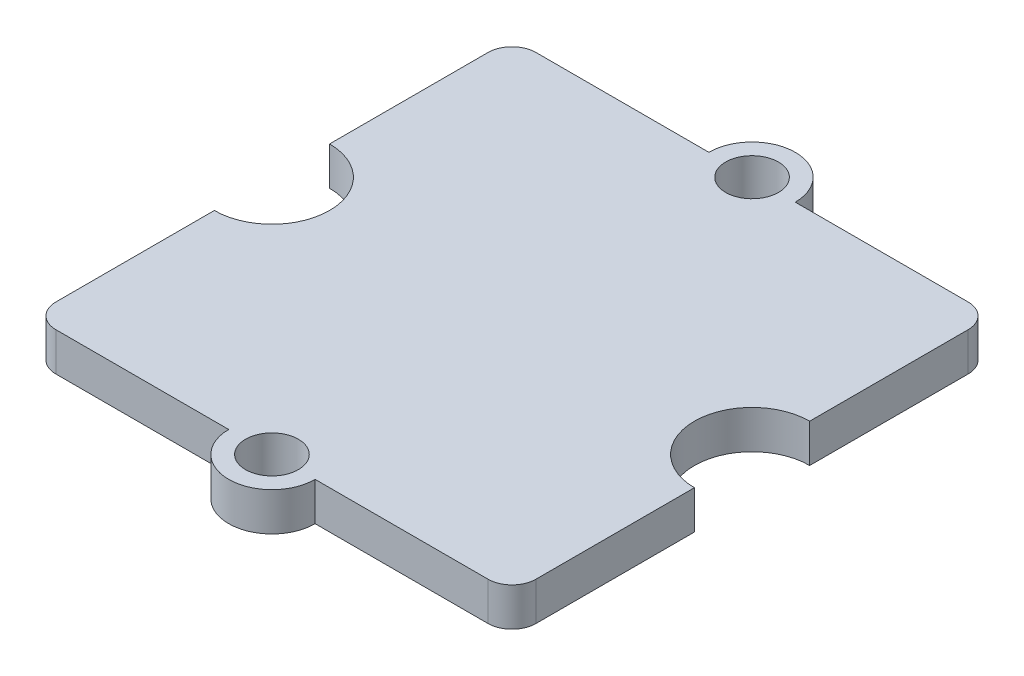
from build123d import *

# Parameters (mm, degrees)
ESQUISSE1_R      = 1.1
EXTRUSION2_DEPTH = 1.6


with BuildPart() as part:
    # Esquisse1 → Extrusion2 (new body)
    with BuildSketch(Plane(origin=(0, 0, 0), x_dir=(1, 0, 0), z_dir=(0, 1, 0))):
        with BuildLine():
            ThreePointArc((1.8, 10), (0, 11.8), (-1.8, 10))
            Line((-1.8, 10), (-9, 10))
            ThreePointArc((-9, 10), (-9.707106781, 9.707106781), (-10, 9))
            Line((-10, 9), (-10, 2.4))
            ThreePointArc((-10, 2.4), (-7.6, 0), (-10, -2.4))
            Line((-10, -2.4), (-10, -9))
            ThreePointArc((-10, -9), (-9.707106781, -9.707106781), (-9, -10))
            Line((-9, -10), (-1.8, -10))
            ThreePointArc((-1.8, -10), (0, -11.8), (1.8, -10))
            Line((1.8, -10), (9, -10))
            ThreePointArc((9, -10), (9.707106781, -9.707106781), (10, -9))
            Line((10, -9), (10, -2.4))
            ThreePointArc((10, -2.4), (7.6, 0), (10, 2.4))
            Line((10, 2.4), (10, 9))
            ThreePointArc((10, 9), (9.707106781, 9.707106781), (9, 10))
            Line((9, 10), (1.8, 10))
        make_face()
        with Locations(Location((0, 10, 0), (0, 0, 270))):
            Circle(ESQUISSE1_R, mode=Mode.SUBTRACT)
        with Locations(Location((0, -10, 0), (0, 0, 270))):
            Circle(ESQUISSE1_R, mode=Mode.SUBTRACT)
    extrude(amount=EXTRUSION2_DEPTH)


solid = part.part
